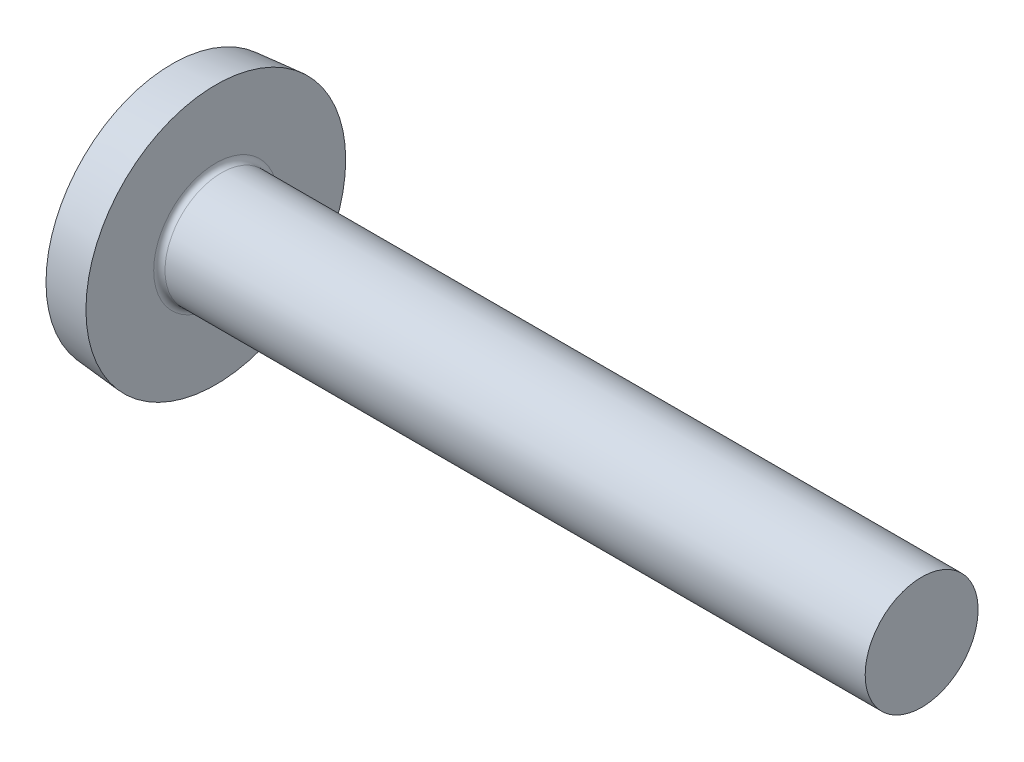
from build123d import *

# Parameters (mm, degrees)
FILLET1_R    = 0.4
RECPAT_COUNT = 2
RECPAT_ANGLE = 90


with BuildPart() as part:
    # BodySke → BaseBody (revolve)
    with BuildSketch(Plane.XY, mode=Mode.PRIVATE) as basebody_sk:
        with BuildLine():
            Line((4.8, 4), (4.8, 9.2))
            Line((4.8, 9.2), (1.7, 8.928785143))
            ThreePointArc((1.7, 8.928785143), (0.428783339, 4.544590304), (0, 0))
            Line((0, 0), (54.8, 0))
            Line((54.8, 0), (54.8, 4))
            Line((54.8, 4), (4.8, 4))
        make_face()
    revolve(basebody_sk.sketch.rotate(Axis((0, 0, 0), (1, 0, 0)), 90), axis=Axis((0, 0, 0), (1, 0, 0)))

    # Fillet1
    fillet1_edges = [part.edges().sort_by_distance(p)[0] for p in [
        (4.8, 0, -4),
    ]]
    fillet(fillet1_edges, radius=FILLET1_R)

    # RecSkeTop → Recess section 0
    with BuildSketch(Plane(origin=(0, 0, 0), x_dir=(0, 0, -1), z_dir=(1, 0, 0))):
        with BuildLine():
            Line((-0.858, 3.9), (0.858, 3.9))
            Line((0.858, 3.9), (0.858, -3.9))
            Line((0.858, -3.9), (-0.858, -3.9))
            Line((-0.858, -3.9), (-0.858, 3.9))
        make_face()
    # RecSkeBot → Recess section 1
    with BuildSketch(Plane(origin=(4.38, 0, 0), x_dir=(0, 0, -1), z_dir=(1, 0, 0))):
        with BuildLine():
            Line((-0.858, 1.716212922), (0.858, 1.716212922))
            Line((0.858, 1.716212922), (0.858, -1.716212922))
            Line((0.858, -1.716212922), (-0.858, -1.716212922))
            Line((-0.858, -1.716212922), (-0.858, 1.716212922))
        make_face()
    recess = loft(mode=Mode.SUBTRACT)

    # RecPat: Recess ×2 about axis
    recpat_axis = Axis((0, 0, 0), (1, 0, 0))
    for i in range(1, RECPAT_COUNT):
        add(recess.rotate(recpat_axis, i * RECPAT_ANGLE / (RECPAT_COUNT - 1)), mode=Mode.SUBTRACT)

    # RecCorSke → RecessCore (revolve, cut)
    with BuildSketch(Plane.XY, mode=Mode.PRIVATE) as recesscore_sk:
        Polygon((0, 0), (0, 1.8876), (4.38, 1.581320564), (4.893802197, 0), align=None)
    revolve(recesscore_sk.sketch.rotate(Axis((0, 0, 0), (1, 0, 0)), 347.103937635), axis=Axis((0, 0, 0), (1, 0, 0)), mode=Mode.SUBTRACT)


solid = part.part
